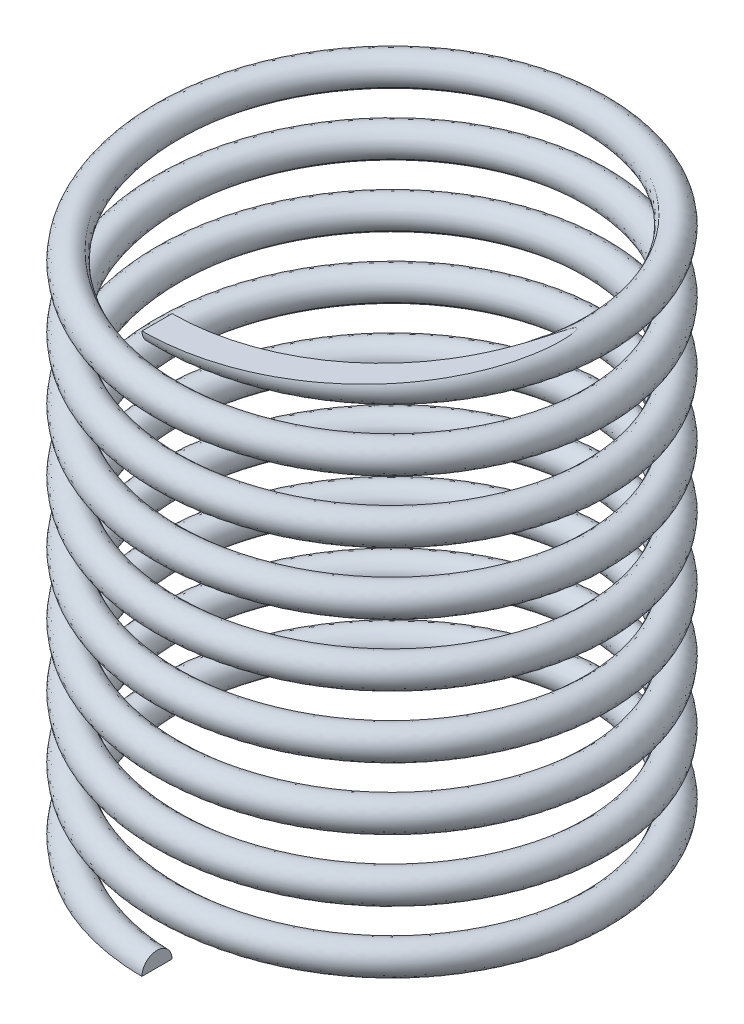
from build123d import *

# Parameters (mm, degrees)
BALAYAGE1_PITCH         = 0.722222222
BALAYAGE1_HEIGHT        = 6.5
BALAYAGE1_RADIUS        = 2.5
ESQUISSE2_R             = 0.175
ESQUISSE3_W             = 3.434887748
ESQUISSE3_H             = 0.853915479
ESQUISSE3_W_2           = 3.114724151
ESQUISSE3_H_2           = 3.504564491
ENL_V_MAT_EXTRU_1_DEPTH = 5


with BuildPart() as part:
    # Balayage1: sweep along a helix
    with BuildLine() as balayage1_path:
        Helix(BALAYAGE1_PITCH, BALAYAGE1_HEIGHT, BALAYAGE1_RADIUS, center=(0, 0, 0), direction=(0, 1, 0), lefthand=True)
    # Esquisse2 → Balayage1 (sweep)
    with BuildSketch(Plane(origin=(0, 0, 0), x_dir=(0, 0, -1), z_dir=(1, 0, 0))):
        with Locations((-2.5, 0)):
            Circle(ESQUISSE2_R)
    sweep(path=balayage1_path.line, is_frenet=True)

    # Esquisse3 → Enl_v. mat.-Extru.1 (cut, symmetric)
    with BuildSketch(Plane.XY):
        with Locations((-1.717443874, -0.42695774)):
            Rectangle(ESQUISSE3_W, ESQUISSE3_H)
        with Locations((1.557362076, 8.252282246)):
            Rectangle(ESQUISSE3_W_2, ESQUISSE3_H_2)
    extrude(amount=ENL_V_MAT_EXTRU_1_DEPTH, both=True, mode=Mode.SUBTRACT)


solid = part.part
